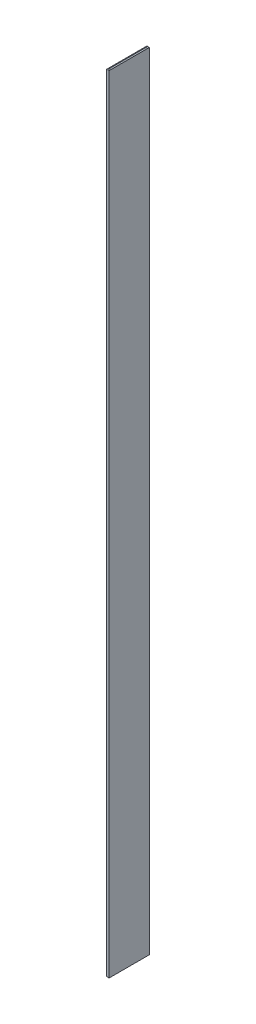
ISO-10303-21;
HEADER;
FILE_DESCRIPTION(('STEP AP214'),'2;1');
FILE_NAME('part.step','',(''),(''),'','','');
FILE_SCHEMA(('AUTOMOTIVE_DESIGN { 1 0 10303 214 1 1 1 1 }'));
ENDSEC;
DATA;
#1=APPLICATION_CONTEXT('core data for automotive mechanical design processes');
#2=APPLICATION_PROTOCOL_DEFINITION('international standard','automotive_design',2000,#1);
#3=PRODUCT_CONTEXT('',#1,'mechanical');
#4=PRODUCT('Part','Part','',(#3));
#5=PRODUCT_RELATED_PRODUCT_CATEGORY('part','',(#4));
#6=PRODUCT_DEFINITION_FORMATION('','',#4);
#7=PRODUCT_DEFINITION_CONTEXT('part definition',#1,'design');
#8=PRODUCT_DEFINITION('design','',#6,#7);
#9=PRODUCT_DEFINITION_SHAPE('','',#8);
#10=(LENGTH_UNIT() NAMED_UNIT(*) SI_UNIT(.MILLI.,.METRE.));
#11=(NAMED_UNIT(*) PLANE_ANGLE_UNIT() SI_UNIT($,.RADIAN.));
#12=(NAMED_UNIT(*) SI_UNIT($,.STERADIAN.) SOLID_ANGLE_UNIT());
#13=UNCERTAINTY_MEASURE_WITH_UNIT(LENGTH_MEASURE(1.E-05),#10,'distance_accuracy_value','');
#14=(GEOMETRIC_REPRESENTATION_CONTEXT(3) GLOBAL_UNCERTAINTY_ASSIGNED_CONTEXT((#13)) GLOBAL_UNIT_ASSIGNED_CONTEXT((#10,
#11,#12)) REPRESENTATION_CONTEXT('',''));
#15=CARTESIAN_POINT('',(0.,0.,0.));
#16=DIRECTION('',(0.,0.,1.));
#17=DIRECTION('',(1.,0.,0.));
#18=AXIS2_PLACEMENT_3D('',#15,#16,#17);
#19=CARTESIAN_POINT('',(-19.05,11946.825,304.8));
#20=DIRECTION('',(1.,0.,0.));
#21=DIRECTION('',(0.,0.,-1.));
#22=AXIS2_PLACEMENT_3D('',#19,#20,#21);
#23=PLANE('',#22);
#24=DIRECTION('',(0.,-1.,0.));
#25=VECTOR('',#24,1.);
#26=CARTESIAN_POINT('',(-19.05,11946.825,-304.8));
#27=LINE('',#26,#25);
#28=CARTESIAN_POINT('',(-19.05,11933.825,-304.8));
#29=VERTEX_POINT('',#28);
#30=CARTESIAN_POINT('',(-19.05,13.0000000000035,-304.8));
#31=VERTEX_POINT('',#30);
#32=EDGE_CURVE('E170',#29,#31,#27,.T.);
#33=ORIENTED_EDGE('',*,*,#32,.T.);
#34=DIRECTION('',(0.,0.,1.));
#35=VECTOR('',#34,1.);
#36=CARTESIAN_POINT('',(-19.05,12.9999999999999,304.8));
#37=LINE('',#36,#35);
#38=CARTESIAN_POINT('',(-19.05,13.0000000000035,304.8));
#39=VERTEX_POINT('',#38);
#40=EDGE_CURVE('E182',#31,#39,#37,.T.);
#41=ORIENTED_EDGE('',*,*,#40,.T.);
#42=DIRECTION('',(0.,-1.,0.));
#43=VECTOR('',#42,1.);
#44=CARTESIAN_POINT('',(-19.05,11946.825,304.8));
#45=LINE('',#44,#43);
#46=CARTESIAN_POINT('',(-19.05,11933.825,304.8));
#47=VERTEX_POINT('',#46);
#48=EDGE_CURVE('E138',#47,#39,#45,.T.);
#49=ORIENTED_EDGE('',*,*,#48,.F.);
#50=DIRECTION('',(0.,0.,-1.));
#51=VECTOR('',#50,1.);
#52=CARTESIAN_POINT('',(-19.05,11933.825,-304.8));
#53=LINE('',#52,#51);
#54=EDGE_CURVE('E184',#47,#29,#53,.T.);
#55=ORIENTED_EDGE('',*,*,#54,.T.);
#56=EDGE_LOOP('',(#33,#41,#49,#55));
#57=FACE_BOUND('',#56,.T.);
#58=ADVANCED_FACE('F50',(#57),#23,.F.);
#59=CARTESIAN_POINT('',(19.05,11946.825,304.8));
#60=DIRECTION('',(0.,0.,-1.));
#61=DIRECTION('',(-1.,0.,0.));
#62=AXIS2_PLACEMENT_3D('',#59,#60,#61);
#63=PLANE('',#62);
#64=ORIENTED_EDGE('',*,*,#48,.T.);
#65=DIRECTION('',(1.,0.,0.));
#66=VECTOR('',#65,1.);
#67=CARTESIAN_POINT('',(19.05,12.9999999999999,304.8));
#68=LINE('',#67,#66);
#69=CARTESIAN_POINT('',(19.05,13.0000000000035,304.8));
#70=VERTEX_POINT('',#69);
#71=EDGE_CURVE('E137',#39,#70,#68,.T.);
#72=ORIENTED_EDGE('',*,*,#71,.T.);
#73=DIRECTION('',(0.,-1.,0.));
#74=VECTOR('',#73,1.);
#75=CARTESIAN_POINT('',(19.05,11946.825,304.8));
#76=LINE('',#75,#74);
#77=CARTESIAN_POINT('',(19.05,11933.825,304.8));
#78=VERTEX_POINT('',#77);
#79=EDGE_CURVE('E120',#78,#70,#76,.T.);
#80=ORIENTED_EDGE('',*,*,#79,.F.);
#81=DIRECTION('',(-1.,0.,0.));
#82=VECTOR('',#81,1.);
#83=CARTESIAN_POINT('',(-19.05,11933.825,304.8));
#84=LINE('',#83,#82);
#85=EDGE_CURVE('E135',#78,#47,#84,.T.);
#86=ORIENTED_EDGE('',*,*,#85,.T.);
#87=EDGE_LOOP('',(#64,#72,#80,#86));
#88=FACE_BOUND('',#87,.T.);
#89=ADVANCED_FACE('F134',(#88),#63,.F.);
#90=CARTESIAN_POINT('',(19.05,11946.825,304.8));
#91=DIRECTION('',(-1.,0.,0.));
#92=DIRECTION('',(0.,0.,1.));
#93=AXIS2_PLACEMENT_3D('',#90,#91,#92);
#94=PLANE('',#93);
#95=ORIENTED_EDGE('',*,*,#79,.T.);
#96=DIRECTION('',(0.,0.,-1.));
#97=VECTOR('',#96,1.);
#98=CARTESIAN_POINT('',(19.05,12.9999999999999,304.8));
#99=LINE('',#98,#97);
#100=CARTESIAN_POINT('',(19.05,13.0000000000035,-304.8));
#101=VERTEX_POINT('',#100);
#102=EDGE_CURVE('E121',#70,#101,#99,.T.);
#103=ORIENTED_EDGE('',*,*,#102,.T.);
#104=DIRECTION('',(0.,-1.,0.));
#105=VECTOR('',#104,1.);
#106=CARTESIAN_POINT('',(19.05,11946.825,-304.8));
#107=LINE('',#106,#105);
#108=CARTESIAN_POINT('',(19.05,11933.825,-304.8));
#109=VERTEX_POINT('',#108);
#110=EDGE_CURVE('E118',#109,#101,#107,.T.);
#111=ORIENTED_EDGE('',*,*,#110,.F.);
#112=DIRECTION('',(0.,0.,1.));
#113=VECTOR('',#112,1.);
#114=CARTESIAN_POINT('',(19.05,11933.825,304.8));
#115=LINE('',#114,#113);
#116=EDGE_CURVE('E113',#109,#78,#115,.T.);
#117=ORIENTED_EDGE('',*,*,#116,.T.);
#118=EDGE_LOOP('',(#95,#103,#111,#117));
#119=FACE_BOUND('',#118,.T.);
#120=ADVANCED_FACE('F119',(#119),#94,.F.);
#121=CARTESIAN_POINT('',(19.05,11946.825,-304.8));
#122=DIRECTION('',(0.,0.,1.));
#123=DIRECTION('',(1.,0.,0.));
#124=AXIS2_PLACEMENT_3D('',#121,#122,#123);
#125=PLANE('',#124);
#126=ORIENTED_EDGE('',*,*,#110,.T.);
#127=DIRECTION('',(-1.,0.,0.));
#128=VECTOR('',#127,1.);
#129=CARTESIAN_POINT('',(19.05,12.9999999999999,-304.8));
#130=LINE('',#129,#128);
#131=EDGE_CURVE('E189',#101,#31,#130,.T.);
#132=ORIENTED_EDGE('',*,*,#131,.T.);
#133=ORIENTED_EDGE('',*,*,#32,.F.);
#134=DIRECTION('',(1.,0.,0.));
#135=VECTOR('',#134,1.);
#136=CARTESIAN_POINT('',(19.05,11933.825,-304.8));
#137=LINE('',#136,#135);
#138=EDGE_CURVE('E188',#29,#109,#137,.T.);
#139=ORIENTED_EDGE('',*,*,#138,.T.);
#140=EDGE_LOOP('',(#126,#132,#133,#139));
#141=FACE_BOUND('',#140,.T.);
#142=ADVANCED_FACE('F236',(#141),#125,.F.);
#143=CARTESIAN_POINT('',(0.,11946.825,0.));
#144=DIRECTION('',(0.,1.,0.));
#145=DIRECTION('',(0.,0.,1.));
#146=AXIS2_PLACEMENT_3D('',#143,#144,#145);
#147=PLANE('',#146);
#148=DIRECTION('',(0.,0.,-1.));
#149=VECTOR('',#148,1.);
#150=CARTESIAN_POINT('',(6.04999999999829,11946.825,-304.8));
#151=LINE('',#150,#149);
#152=CARTESIAN_POINT('',(6.04999999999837,11946.825,291.799999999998));
#153=VERTEX_POINT('',#152);
#154=CARTESIAN_POINT('',(6.0499999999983,11946.825,-291.799999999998));
#155=VERTEX_POINT('',#154);
#156=EDGE_CURVE('E59',#153,#155,#151,.T.);
#157=ORIENTED_EDGE('',*,*,#156,.T.);
#158=DIRECTION('',(-1.,0.,0.));
#159=VECTOR('',#158,1.);
#160=CARTESIAN_POINT('',(-19.05,11946.825,-291.799999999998));
#161=LINE('',#160,#159);
#162=CARTESIAN_POINT('',(-6.04999999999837,11946.825,-291.799999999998));
#163=VERTEX_POINT('',#162);
#164=EDGE_CURVE('E11',#155,#163,#161,.T.);
#165=ORIENTED_EDGE('',*,*,#164,.T.);
#166=DIRECTION('',(0.,0.,1.));
#167=VECTOR('',#166,1.);
#168=CARTESIAN_POINT('',(-6.04999999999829,11946.825,304.8));
#169=LINE('',#168,#167);
#170=CARTESIAN_POINT('',(-6.04999999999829,11946.825,291.799999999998));
#171=VERTEX_POINT('',#170);
#172=EDGE_CURVE('E178',#163,#171,#169,.T.);
#173=ORIENTED_EDGE('',*,*,#172,.T.);
#174=DIRECTION('',(1.,0.,0.));
#175=VECTOR('',#174,1.);
#176=CARTESIAN_POINT('',(19.05,11946.825,291.799999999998));
#177=LINE('',#176,#175);
#178=EDGE_CURVE('E69',#171,#153,#177,.T.);
#179=ORIENTED_EDGE('',*,*,#178,.T.);
#180=EDGE_LOOP('',(#157,#165,#173,#179));
#181=FACE_BOUND('',#180,.T.);
#182=ADVANCED_FACE('F241',(#181),#147,.T.);
#183=CARTESIAN_POINT('',(0.,0.,0.));
#184=DIRECTION('',(0.,1.,0.));
#185=DIRECTION('',(0.,0.,1.));
#186=AXIS2_PLACEMENT_3D('',#183,#184,#185);
#187=PLANE('',#186);
#188=DIRECTION('',(0.,0.,1.));
#189=VECTOR('',#188,1.);
#190=CARTESIAN_POINT('',(6.05000000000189,0.,0.));
#191=LINE('',#190,#189);
#192=CARTESIAN_POINT('',(6.05000000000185,0.,-291.800000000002));
#193=VERTEX_POINT('',#192);
#194=CARTESIAN_POINT('',(6.05000000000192,0.,291.800000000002));
#195=VERTEX_POINT('',#194);
#196=EDGE_CURVE('E196',#193,#195,#191,.T.);
#197=ORIENTED_EDGE('',*,*,#196,.T.);
#198=DIRECTION('',(-1.,0.,0.));
#199=VECTOR('',#198,1.);
#200=CARTESIAN_POINT('',(0.,0.,291.800000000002));
#201=LINE('',#200,#199);
#202=CARTESIAN_POINT('',(-6.05000000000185,0.,291.800000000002));
#203=VERTEX_POINT('',#202);
#204=EDGE_CURVE('E127',#195,#203,#201,.T.);
#205=ORIENTED_EDGE('',*,*,#204,.T.);
#206=DIRECTION('',(0.,0.,-1.));
#207=VECTOR('',#206,1.);
#208=CARTESIAN_POINT('',(-6.05000000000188,0.,0.));
#209=LINE('',#208,#207);
#210=CARTESIAN_POINT('',(-6.05000000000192,0.,-291.800000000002));
#211=VERTEX_POINT('',#210);
#212=EDGE_CURVE('E204',#203,#211,#209,.T.);
#213=ORIENTED_EDGE('',*,*,#212,.T.);
#214=DIRECTION('',(1.,0.,0.));
#215=VECTOR('',#214,1.);
#216=CARTESIAN_POINT('',(0.,0.,-291.800000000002));
#217=LINE('',#216,#215);
#218=EDGE_CURVE('E203',#211,#193,#217,.T.);
#219=ORIENTED_EDGE('',*,*,#218,.T.);
#220=EDGE_LOOP('',(#197,#205,#213,#219));
#221=FACE_BOUND('',#220,.T.);
#222=ADVANCED_FACE('F247',(#221),#187,.F.);
#223=CARTESIAN_POINT('',(19.05,12.9999999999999,-304.8));
#224=DIRECTION('',(0.,0.707106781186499,0.707106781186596));
#225=DIRECTION('',(-1.,0.,0.));
#226=AXIS2_PLACEMENT_3D('',#223,#224,#225);
#227=PLANE('',#226);
#228=DIRECTION('',(-0.577350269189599,-0.577350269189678,0.5773502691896));
#229=VECTOR('',#228,1.);
#230=CARTESIAN_POINT('',(19.05,12.9999999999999,-304.8));
#231=LINE('',#230,#229);
#232=EDGE_CURVE('E169',#193,#101,#231,.F.);
#233=ORIENTED_EDGE('',*,*,#232,.F.);
#234=ORIENTED_EDGE('',*,*,#218,.F.);
#235=DIRECTION('',(0.577350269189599,-0.577350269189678,0.5773502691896));
#236=VECTOR('',#235,1.);
#237=CARTESIAN_POINT('',(184.149999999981,-190.200000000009,-101.600000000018));
#238=LINE('',#237,#236);
#239=EDGE_CURVE('E162',#31,#211,#238,.T.);
#240=ORIENTED_EDGE('',*,*,#239,.F.);
#241=ORIENTED_EDGE('',*,*,#131,.F.);
#242=EDGE_LOOP('',(#233,#234,#240,#241));
#243=FACE_BOUND('',#242,.T.);
#244=ADVANCED_FACE('F223',(#243),#227,.F.);
#245=CARTESIAN_POINT('',(-19.05,12.9999999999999,304.8));
#246=DIRECTION('',(0.707106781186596,0.707106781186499,0.));
#247=DIRECTION('',(0.,0.,1.));
#248=AXIS2_PLACEMENT_3D('',#245,#246,#247);
#249=PLANE('',#248);
#250=ORIENTED_EDGE('',*,*,#239,.T.);
#251=ORIENTED_EDGE('',*,*,#212,.F.);
#252=DIRECTION('',(-0.577350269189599,0.577350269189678,0.5773502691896));
#253=VECTOR('',#252,1.);
#254=CARTESIAN_POINT('',(-19.05,12.9999999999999,304.8));
#255=LINE('',#254,#253);
#256=EDGE_CURVE('E155',#39,#203,#255,.F.);
#257=ORIENTED_EDGE('',*,*,#256,.F.);
#258=ORIENTED_EDGE('',*,*,#40,.F.);
#259=EDGE_LOOP('',(#250,#251,#257,#258));
#260=FACE_BOUND('',#259,.T.);
#261=ADVANCED_FACE('F226',(#260),#249,.F.);
#262=CARTESIAN_POINT('',(19.05,12.9999999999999,304.8));
#263=DIRECTION('',(-0.707106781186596,0.707106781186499,0.));
#264=DIRECTION('',(0.,0.,-1.));
#265=AXIS2_PLACEMENT_3D('',#262,#263,#264);
#266=PLANE('',#265);
#267=ORIENTED_EDGE('',*,*,#232,.T.);
#268=ORIENTED_EDGE('',*,*,#102,.F.);
#269=DIRECTION('',(-0.577350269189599,-0.577350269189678,-0.5773502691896));
#270=VECTOR('',#269,1.);
#271=CARTESIAN_POINT('',(19.05,12.9999999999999,304.8));
#272=LINE('',#271,#270);
#273=EDGE_CURVE('E149',#195,#70,#272,.F.);
#274=ORIENTED_EDGE('',*,*,#273,.F.);
#275=ORIENTED_EDGE('',*,*,#196,.F.);
#276=EDGE_LOOP('',(#267,#268,#274,#275));
#277=FACE_BOUND('',#276,.T.);
#278=ADVANCED_FACE('F240',(#277),#266,.F.);
#279=CARTESIAN_POINT('',(19.05,12.9999999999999,304.8));
#280=DIRECTION('',(0.,0.707106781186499,-0.707106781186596));
#281=DIRECTION('',(1.,0.,0.));
#282=AXIS2_PLACEMENT_3D('',#279,#280,#281);
#283=PLANE('',#282);
#284=ORIENTED_EDGE('',*,*,#256,.T.);
#285=ORIENTED_EDGE('',*,*,#204,.F.);
#286=ORIENTED_EDGE('',*,*,#273,.T.);
#287=ORIENTED_EDGE('',*,*,#71,.F.);
#288=EDGE_LOOP('',(#284,#285,#286,#287));
#289=FACE_BOUND('',#288,.T.);
#290=ADVANCED_FACE('F235',(#289),#283,.F.);
#291=CARTESIAN_POINT('',(0.,11946.825,291.799999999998));
#292=DIRECTION('',(0.,0.707106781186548,0.707106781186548));
#293=DIRECTION('',(-1.,0.,0.));
#294=AXIS2_PLACEMENT_3D('',#291,#292,#293);
#295=PLANE('',#294);
#296=DIRECTION('',(0.577350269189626,0.577350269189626,-0.577350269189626));
#297=VECTOR('',#296,1.);
#298=CARTESIAN_POINT('',(91.2166666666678,12044.0916666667,194.533333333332));
#299=LINE('',#298,#297);
#300=EDGE_CURVE('E141',#47,#171,#299,.T.);
#301=ORIENTED_EDGE('',*,*,#300,.F.);
#302=ORIENTED_EDGE('',*,*,#85,.F.);
#303=DIRECTION('',(-0.577350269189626,0.577350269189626,-0.577350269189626));
#304=VECTOR('',#303,1.);
#305=CARTESIAN_POINT('',(4.03333333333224,11948.8416666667,289.783333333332));
#306=LINE('',#305,#304);
#307=EDGE_CURVE('E55',#153,#78,#306,.F.);
#308=ORIENTED_EDGE('',*,*,#307,.F.);
#309=ORIENTED_EDGE('',*,*,#178,.F.);
#310=EDGE_LOOP('',(#301,#302,#308,#309));
#311=FACE_BOUND('',#310,.T.);
#312=ADVANCED_FACE('F49',(#311),#295,.T.);
#313=CARTESIAN_POINT('',(6.04999999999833,11946.825,0.));
#314=DIRECTION('',(0.707106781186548,0.707106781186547,0.));
#315=DIRECTION('',(0.,0.,1.));
#316=AXIS2_PLACEMENT_3D('',#313,#314,#315);
#317=PLANE('',#316);
#318=ORIENTED_EDGE('',*,*,#307,.T.);
#319=ORIENTED_EDGE('',*,*,#116,.F.);
#320=DIRECTION('',(-0.577350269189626,0.577350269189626,0.577350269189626));
#321=VECTOR('',#320,1.);
#322=CARTESIAN_POINT('',(-91.2166666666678,12044.0916666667,-194.533333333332));
#323=LINE('',#322,#321);
#324=EDGE_CURVE('E152',#155,#109,#323,.F.);
#325=ORIENTED_EDGE('',*,*,#324,.F.);
#326=ORIENTED_EDGE('',*,*,#156,.F.);
#327=EDGE_LOOP('',(#318,#319,#325,#326));
#328=FACE_BOUND('',#327,.T.);
#329=ADVANCED_FACE('F150',(#328),#317,.T.);
#330=CARTESIAN_POINT('',(-6.04999999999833,11946.825,0.));
#331=DIRECTION('',(-0.707106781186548,0.707106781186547,0.));
#332=DIRECTION('',(0.,0.,-1.));
#333=AXIS2_PLACEMENT_3D('',#330,#331,#332);
#334=PLANE('',#333);
#335=ORIENTED_EDGE('',*,*,#300,.T.);
#336=ORIENTED_EDGE('',*,*,#172,.F.);
#337=DIRECTION('',(-0.577350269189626,-0.577350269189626,-0.577350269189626));
#338=VECTOR('',#337,1.);
#339=CARTESIAN_POINT('',(91.2166666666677,12044.0916666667,-194.533333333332));
#340=LINE('',#339,#338);
#341=EDGE_CURVE('E158',#29,#163,#340,.F.);
#342=ORIENTED_EDGE('',*,*,#341,.F.);
#343=ORIENTED_EDGE('',*,*,#54,.F.);
#344=EDGE_LOOP('',(#335,#336,#342,#343));
#345=FACE_BOUND('',#344,.T.);
#346=ADVANCED_FACE('F245',(#345),#334,.T.);
#347=CARTESIAN_POINT('',(0.,11946.825,-291.799999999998));
#348=DIRECTION('',(0.,0.707106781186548,-0.707106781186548));
#349=DIRECTION('',(1.,0.,0.));
#350=AXIS2_PLACEMENT_3D('',#347,#348,#349);
#351=PLANE('',#350);
#352=ORIENTED_EDGE('',*,*,#324,.T.);
#353=ORIENTED_EDGE('',*,*,#138,.F.);
#354=ORIENTED_EDGE('',*,*,#341,.T.);
#355=ORIENTED_EDGE('',*,*,#164,.F.);
#356=EDGE_LOOP('',(#352,#353,#354,#355));
#357=FACE_BOUND('',#356,.T.);
#358=ADVANCED_FACE('F242',(#357),#351,.T.);
#359=CLOSED_SHELL('',(#58,#89,#120,#142,#182,#222,#244,#261,#278,#290,#312,#329,#346,#358));
#360=MANIFOLD_SOLID_BREP('B2',#359);
#361=ADVANCED_BREP_SHAPE_REPRESENTATION('',(#18,#360),#14);
#362=SHAPE_DEFINITION_REPRESENTATION(#9,#361);
ENDSEC;
END-ISO-10303-21;
